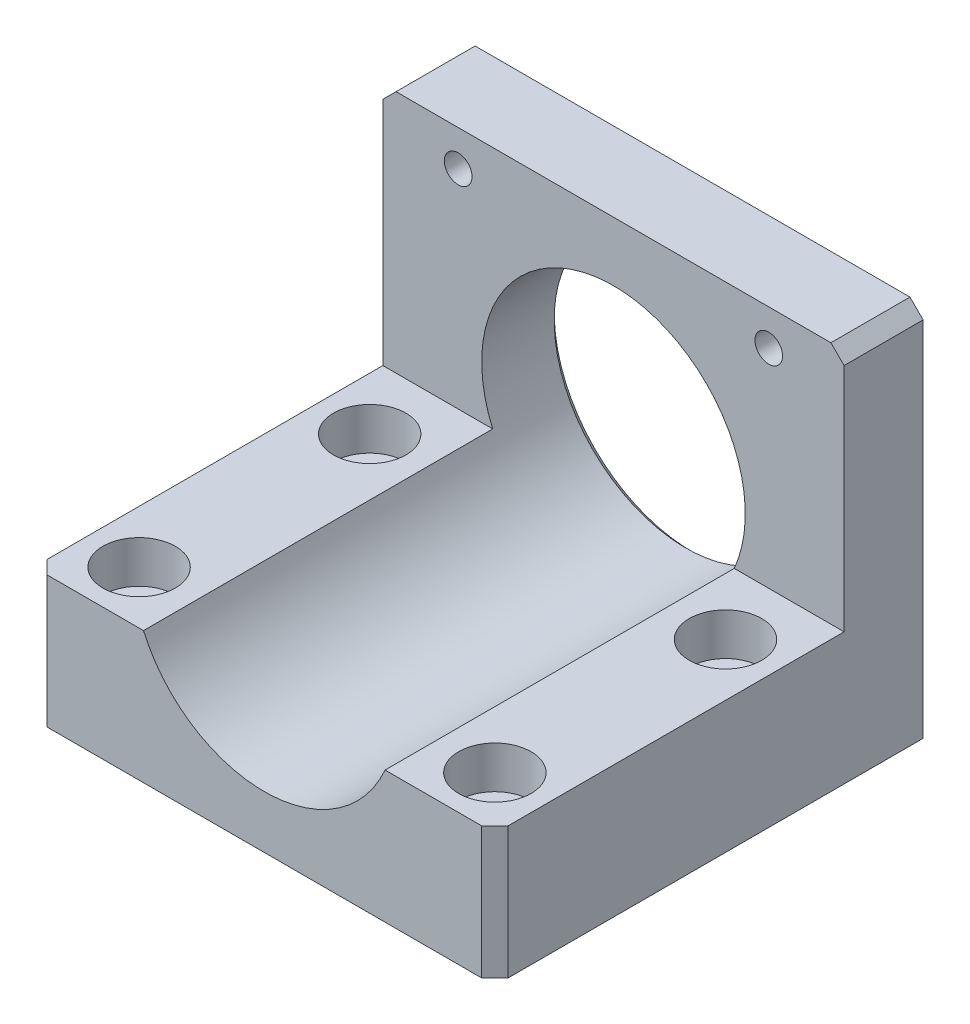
from build123d import *

# Parameters (mm, degrees)
ESQUISSE1_W                                        = 70
ESQUISSE1_H                                        = 57
ESQUISSE1_R                                        = 20
BOSS_EXTRU_1_DEPTH                                 = 65
TROU_TARAUD_M51_D                                  = 4.2
TROU_TARAUD_M51_DEPTH                              = 14
TROU_TARAUD_M51_TIP                                = 1.2618073
ENL_V_MAT_EXTRU_1_DEPTH                            = 80.315824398
ENL_V_MAT_EXTRU_1_DEPTH_BACK                       = 80.315824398
ESQUISSE4_W                                        = 53
ESQUISSE4_H                                        = 37
CHAMBRAGE_POUR_VIS_T_TE_HEXAGONALE_M61_D           = 6.4
CHAMBRAGE_POUR_VIS_T_TE_HEXAGONALE_M61_CBORE_D     = 11
CHAMBRAGE_POUR_VIS_T_TE_HEXAGONALE_M61_CBORE_DEPTH = 6.4
CHANFREIN2_SIZE                                    = 2
CHANFREIN3_SIZE                                    = 1


with BuildPart() as part:
    # Esquisse1 → Boss.-Extru.1 (new body)
    with BuildSketch(Plane.XY):
        with Locations((0, 0.5)):
            Rectangle(ESQUISSE1_W, ESQUISSE1_H)
        Circle(ESQUISSE1_R, mode=Mode.SUBTRACT)
    extrude(amount=BOSS_EXTRU_1_DEPTH)

    # Trou taraud_ M51
    with Locations(Plane(origin=(0, 0, 0), x_dir=(-1, 0, 0), z_dir=(0, 0, -1))):
        with Locations((-23.57, 23.57), (23.57, 23.57), (23.57, -23.57), (-23.57, -23.57)):
            Hole(TROU_TARAUD_M51_D / 2, depth=TROU_TARAUD_M51_DEPTH)
            with Locations((0, 0, -(TROU_TARAUD_M51_DEPTH + TROU_TARAUD_M51_TIP / 2))):  # 118° drill point
                Cone(0, TROU_TARAUD_M51_D / 2, TROU_TARAUD_M51_TIP, mode=Mode.SUBTRACT)

    # Esquisse4 → Enl_v. mat.-Extru.1 (cut, two sides: drawn at the far end of the back side and taken through both)
    with BuildSketch(Plane(origin=(0, 0, 0), x_dir=(0, 0, -1), z_dir=(1, 0, 0)).offset(-ENL_V_MAT_EXTRU_1_DEPTH_BACK)):
        with Locations((-38.5, 10.5)):
            Rectangle(ESQUISSE4_W, ESQUISSE4_H)
    extrude(amount=ENL_V_MAT_EXTRU_1_DEPTH + ENL_V_MAT_EXTRU_1_DEPTH_BACK, mode=Mode.SUBTRACT)

    # Chambrage pour vis _ t_te hexagonale M61 (through all)
    with Locations(Plane(origin=(0, -8, 0), x_dir=(1, 0, 0), z_dir=(0, 1, 0))):
        with Locations((-27, -22), (-27, -57), (27, -57), (27, -22)):
            CounterBoreHole(CHAMBRAGE_POUR_VIS_T_TE_HEXAGONALE_M61_D / 2, CHAMBRAGE_POUR_VIS_T_TE_HEXAGONALE_M61_CBORE_D / 2, CHAMBRAGE_POUR_VIS_T_TE_HEXAGONALE_M61_CBORE_DEPTH)

    # Chanfrein2
    chanfrein2_edges = [part.edges().sort_by_distance(p)[0] for p in [
        (35, -18, 65),
        (-35, 29, 6),
        (35, 29, 6),
        (-35, -18, 65),
    ]]
    chamfer(chanfrein2_edges, length=CHANFREIN2_SIZE)

    # Chanfrein3
    chanfrein3_edges = [part.edges().sort_by_distance(p)[0] for p in [
        (-20, 0, 0),
    ]]
    chamfer(chanfrein3_edges, length=CHANFREIN3_SIZE)


solid = part.part
